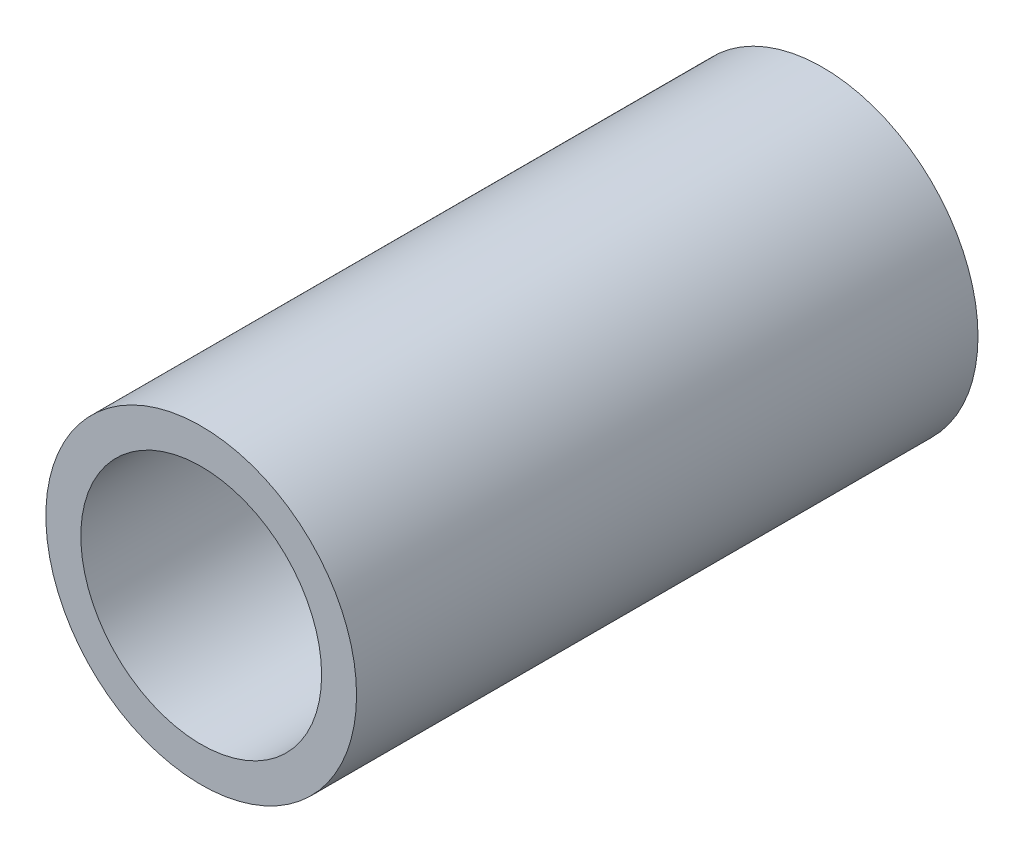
from build123d import *

# Parameters (mm, degrees)
ESQUISSE1_R      = 2
ESQUISSE1_R_2    = 1.55
EXTRUSION1_DEPTH = 8


with BuildPart() as part:
    # Esquisse1 → Extrusion1 (new body)
    with BuildSketch(Plane.XY):
        Circle(ESQUISSE1_R)
        Circle(ESQUISSE1_R_2, mode=Mode.SUBTRACT)
    extrude(amount=EXTRUSION1_DEPTH)


solid = part.part
